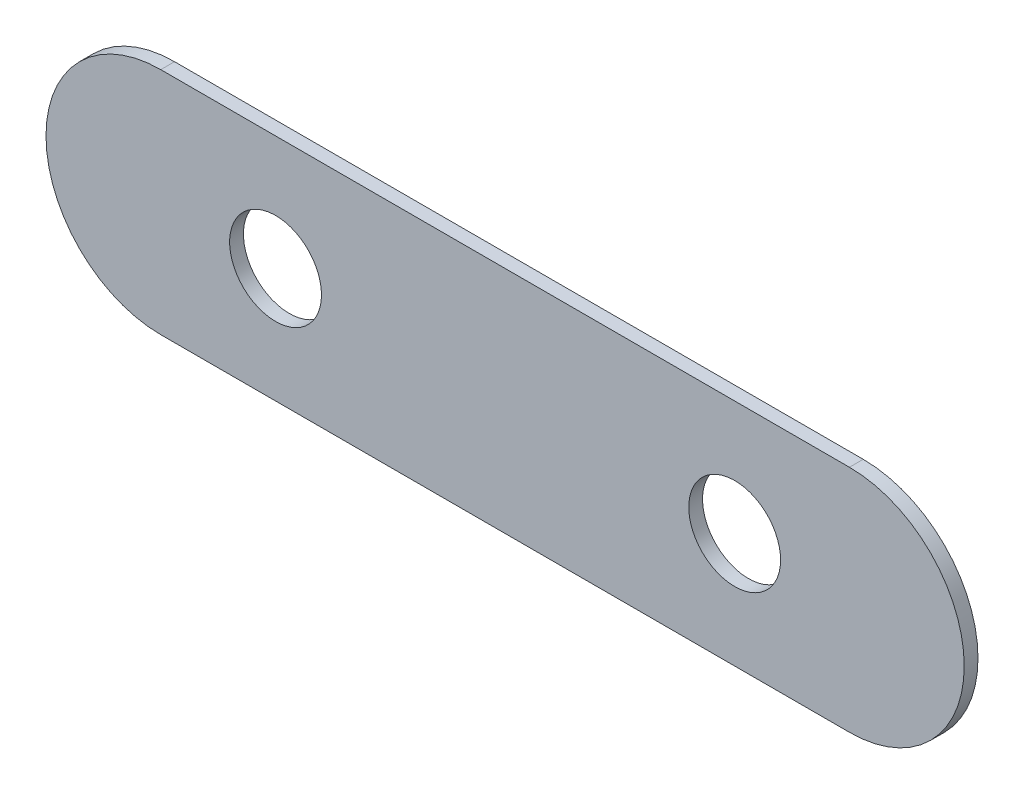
from build123d import *

# Parameters (mm, degrees)
RESSALTO_EXTRUS_O1_DEPTH = 0.3


with BuildPart() as part:
    # Esbo_o1 → Ressalto-extrus_o1 (new body)
    with BuildSketch(Plane.XY):
        with BuildLine():
            Line((-34.788448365, 5.156909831), (-34.788448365, 10.156909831))
            ThreePointArc((-34.788448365, 10.156909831), (-37.288448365, 7.656909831), (-34.788448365, 5.156909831))
        make_face()
        with BuildLine():
            ThreePointArc((-32.488448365, 8.636705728), (-33.409950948, 9.742514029), (-34.788448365, 10.156909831))
            Line((-34.788448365, 10.156909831), (-34.788448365, 5.156909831))
            ThreePointArc((-34.788448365, 5.156909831), (-33.409950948, 5.571305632), (-32.488448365, 6.677113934))
            ThreePointArc((-32.488448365, 6.677113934), (-33.288448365, 7.656909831), (-32.488448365, 8.636705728))
        make_face()
        with BuildLine():
            Line((-19.788448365, 10.156909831), (-34.788448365, 10.156909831))
            ThreePointArc((-34.788448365, 10.156909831), (-33.409950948, 9.742514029), (-32.488448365, 8.636705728))
            ThreePointArc((-32.488448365, 8.636705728), (-31.655992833, 8.4315065), (-31.288448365, 7.656909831))
            ThreePointArc((-31.288448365, 7.656909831), (-31.655992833, 6.882313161), (-32.488448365, 6.677113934))
            ThreePointArc((-32.488448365, 6.677113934), (-33.409950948, 5.571305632), (-34.788448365, 5.156909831))
            Line((-34.788448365, 5.156909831), (-19.788448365, 5.156909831))
            ThreePointArc((-19.788448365, 5.156909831), (-21.166945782, 5.571305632), (-22.088448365, 6.677113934))
            ThreePointArc((-22.088448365, 6.677113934), (-23.288448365, 7.656909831), (-22.088448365, 8.636705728))
            ThreePointArc((-22.088448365, 8.636705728), (-21.166945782, 9.742514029), (-19.788448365, 10.156909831))
        make_face()
        with BuildLine():
            ThreePointArc((-17.288448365, 7.656909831), (-18.020681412, 9.424676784), (-19.788448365, 10.156909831))
            Line((-19.788448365, 10.156909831), (-19.788448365, 5.156909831))
            ThreePointArc((-19.788448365, 5.156909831), (-18.020681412, 5.889142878), (-17.288448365, 7.656909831))
        make_face()
        with BuildLine():
            Line((-19.788448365, 5.156909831), (-19.788448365, 10.156909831))
            ThreePointArc((-19.788448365, 10.156909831), (-21.166945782, 9.742514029), (-22.088448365, 8.636705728))
            ThreePointArc((-22.088448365, 8.636705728), (-21.513851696, 8.289365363), (-21.288448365, 7.656909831))
            ThreePointArc((-21.288448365, 7.656909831), (-21.513851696, 7.024454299), (-22.088448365, 6.677113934))
            ThreePointArc((-22.088448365, 6.677113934), (-21.166945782, 5.571305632), (-19.788448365, 5.156909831))
        make_face()
    extrude(amount=RESSALTO_EXTRUS_O1_DEPTH)


solid = part.part
